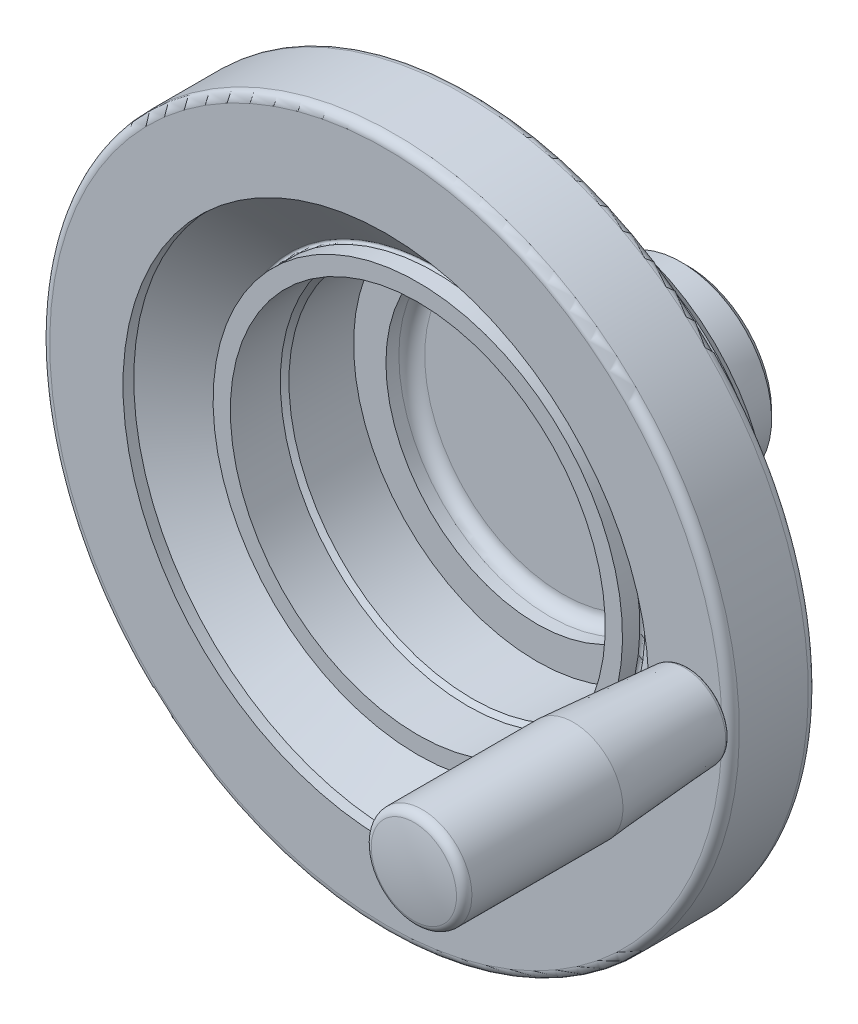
ISO-10303-21;
HEADER;
FILE_DESCRIPTION(('STEP AP214'),'2;1');
FILE_NAME('part.step','',(''),(''),'','','');
FILE_SCHEMA(('AUTOMOTIVE_DESIGN { 1 0 10303 214 1 1 1 1 }'));
ENDSEC;
DATA;
#1=APPLICATION_CONTEXT('core data for automotive mechanical design processes');
#2=APPLICATION_PROTOCOL_DEFINITION('international standard','automotive_design',2000,#1);
#3=PRODUCT_CONTEXT('',#1,'mechanical');
#4=PRODUCT('Part','Part','',(#3));
#5=PRODUCT_RELATED_PRODUCT_CATEGORY('part','',(#4));
#6=PRODUCT_DEFINITION_FORMATION('','',#4);
#7=PRODUCT_DEFINITION_CONTEXT('part definition',#1,'design');
#8=PRODUCT_DEFINITION('design','',#6,#7);
#9=PRODUCT_DEFINITION_SHAPE('','',#8);
#10=(LENGTH_UNIT() NAMED_UNIT(*) SI_UNIT(.MILLI.,.METRE.));
#11=(NAMED_UNIT(*) PLANE_ANGLE_UNIT() SI_UNIT($,.RADIAN.));
#12=(NAMED_UNIT(*) SI_UNIT($,.STERADIAN.) SOLID_ANGLE_UNIT());
#13=UNCERTAINTY_MEASURE_WITH_UNIT(LENGTH_MEASURE(1.E-05),#10,'distance_accuracy_value','');
#14=(GEOMETRIC_REPRESENTATION_CONTEXT(3) GLOBAL_UNCERTAINTY_ASSIGNED_CONTEXT((#13)) GLOBAL_UNIT_ASSIGNED_CONTEXT((#10,
#11,#12)) REPRESENTATION_CONTEXT('',''));
#15=CARTESIAN_POINT('',(0.,0.,0.));
#16=DIRECTION('',(0.,0.,1.));
#17=DIRECTION('',(1.,0.,0.));
#18=AXIS2_PLACEMENT_3D('',#15,#16,#17);
#19=CARTESIAN_POINT('',(0.,0.,62.6));
#20=DIRECTION('',(0.,0.,1.));
#21=DIRECTION('',(0.,-1.,0.));
#22=AXIS2_PLACEMENT_3D('',#19,#20,#21);
#23=PLANE('',#22);
#24=CARTESIAN_POINT('',(0.,0.,62.6));
#25=DIRECTION('',(0.,0.,1.));
#26=DIRECTION('',(0.,-1.,0.));
#27=AXIS2_PLACEMENT_3D('',#24,#25,#26);
#28=CIRCLE('',#27,47.5);
#29=CARTESIAN_POINT('',(0.,-47.5,62.6));
#30=VERTEX_POINT('',#29);
#31=EDGE_CURVE('E173',#30,#30,#28,.T.);
#32=ORIENTED_EDGE('',*,*,#31,.T.);
#33=EDGE_LOOP('',(#32));
#34=FACE_BOUND('',#33,.T.);
#35=CARTESIAN_POINT('',(0.,0.,62.6));
#36=DIRECTION('',(0.,0.,1.));
#37=DIRECTION('',(0.,-1.,0.));
#38=AXIS2_PLACEMENT_3D('',#35,#36,#37);
#39=CIRCLE('',#38,43.5);
#40=CARTESIAN_POINT('',(0.,-43.5,62.6));
#41=VERTEX_POINT('',#40);
#42=EDGE_CURVE('E18',#41,#41,#39,.F.);
#43=ORIENTED_EDGE('',*,*,#42,.T.);
#44=EDGE_LOOP('',(#43));
#45=FACE_BOUND('',#44,.T.);
#46=ADVANCED_FACE('F14',(#34,#45),#23,.T.);
#47=CARTESIAN_POINT('',(0.,0.,27.));
#48=DIRECTION('',(0.,0.,-1.));
#49=DIRECTION('',(0.,1.,0.));
#50=AXIS2_PLACEMENT_3D('',#47,#48,#49);
#51=CYLINDRICAL_SURFACE('',#50,4.);
#52=CARTESIAN_POINT('',(0.,0.,0.));
#53=DIRECTION('',(0.,0.,-1.));
#54=DIRECTION('',(0.,1.,0.));
#55=AXIS2_PLACEMENT_3D('',#52,#53,#54);
#56=CIRCLE('',#55,4.);
#57=CARTESIAN_POINT('',(0.,4.,0.));
#58=VERTEX_POINT('',#57);
#59=EDGE_CURVE('E197',#58,#58,#56,.T.);
#60=ORIENTED_EDGE('',*,*,#59,.T.);
#61=EDGE_LOOP('',(#60));
#62=FACE_BOUND('',#61,.T.);
#63=CARTESIAN_POINT('',(0.,0.,29.));
#64=DIRECTION('',(0.,0.,1.));
#65=DIRECTION('',(0.,-1.,0.));
#66=AXIS2_PLACEMENT_3D('',#63,#64,#65);
#67=CIRCLE('',#66,4.);
#68=CARTESIAN_POINT('',(0.,-4.,29.));
#69=VERTEX_POINT('',#68);
#70=EDGE_CURVE('E55',#69,#69,#67,.F.);
#71=ORIENTED_EDGE('',*,*,#70,.F.);
#72=EDGE_LOOP('',(#71));
#73=FACE_BOUND('',#72,.T.);
#74=ADVANCED_FACE('F95',(#62,#73),#51,.F.);
#75=CARTESIAN_POINT('',(-78.,0.,70.));
#76=DIRECTION('',(0.,0.,-1.));
#77=DIRECTION('',(0.,1.,0.));
#78=AXIS2_PLACEMENT_3D('',#75,#76,#77);
#79=PLANE('',#78);
#80=CARTESIAN_POINT('',(0.,0.,70.));
#81=DIRECTION('',(0.,0.,1.));
#82=DIRECTION('',(0.,-1.,0.));
#83=AXIS2_PLACEMENT_3D('',#80,#81,#82);
#84=CIRCLE('',#83,78.);
#85=CARTESIAN_POINT('',(0.,-78.,70.));
#86=VERTEX_POINT('',#85);
#87=EDGE_CURVE('E188',#86,#86,#84,.T.);
#88=ORIENTED_EDGE('',*,*,#87,.T.);
#89=EDGE_LOOP('',(#88));
#90=FACE_BOUND('',#89,.T.);
#91=CARTESIAN_POINT('',(0.,0.,70.));
#92=DIRECTION('',(0.,0.,1.));
#93=DIRECTION('',(0.,-1.,0.));
#94=AXIS2_PLACEMENT_3D('',#91,#92,#93);
#95=CIRCLE('',#94,61.);
#96=CARTESIAN_POINT('',(0.,-61.,70.));
#97=VERTEX_POINT('',#96);
#98=EDGE_CURVE('E185',#97,#97,#95,.T.);
#99=ORIENTED_EDGE('',*,*,#98,.F.);
#100=EDGE_LOOP('',(#99));
#101=FACE_BOUND('',#100,.T.);
#102=CARTESIAN_POINT('',(70.5,0.,70.));
#103=DIRECTION('',(0.,0.,-1.));
#104=DIRECTION('',(0.,1.,0.));
#105=AXIS2_PLACEMENT_3D('',#102,#103,#104);
#106=CIRCLE('',#105,6.);
#107=CARTESIAN_POINT('',(70.5,6.,70.));
#108=VERTEX_POINT('',#107);
#109=EDGE_CURVE('E22',#108,#108,#106,.F.);
#110=ORIENTED_EDGE('',*,*,#109,.F.);
#111=EDGE_LOOP('',(#110));
#112=FACE_BOUND('',#111,.T.);
#113=ADVANCED_FACE('F98',(#90,#101,#112),#79,.F.);
#114=CARTESIAN_POINT('',(0.,0.,52.));
#115=DIRECTION('',(0.,0.,1.));
#116=DIRECTION('',(0.,-1.,0.));
#117=AXIS2_PLACEMENT_3D('',#114,#115,#116);
#118=TOROIDAL_SURFACE('',#117,78.,2.);
#119=CARTESIAN_POINT('',(0.,0.,50.));
#120=DIRECTION('',(0.,0.,1.));
#121=DIRECTION('',(0.,-1.,0.));
#122=AXIS2_PLACEMENT_3D('',#119,#120,#121);
#123=CIRCLE('',#122,78.);
#124=CARTESIAN_POINT('',(0.,-78.,50.));
#125=VERTEX_POINT('',#124);
#126=EDGE_CURVE('E40',#125,#125,#123,.T.);
#127=ORIENTED_EDGE('',*,*,#126,.T.);
#128=EDGE_LOOP('',(#127));
#129=FACE_BOUND('',#128,.T.);
#130=CARTESIAN_POINT('',(0.,0.,52.));
#131=DIRECTION('',(0.,0.,1.));
#132=DIRECTION('',(0.,-1.,0.));
#133=AXIS2_PLACEMENT_3D('',#130,#131,#132);
#134=CIRCLE('',#133,80.);
#135=CARTESIAN_POINT('',(0.,-80.,52.));
#136=VERTEX_POINT('',#135);
#137=EDGE_CURVE('E194',#136,#136,#134,.T.);
#138=ORIENTED_EDGE('',*,*,#137,.F.);
#139=EDGE_LOOP('',(#138));
#140=FACE_BOUND('',#139,.T.);
#141=ADVANCED_FACE('F16',(#129,#140),#118,.T.);
#142=CARTESIAN_POINT('',(-78.,0.,50.));
#143=DIRECTION('',(0.,0.,-1.));
#144=DIRECTION('',(0.,1.,0.));
#145=AXIS2_PLACEMENT_3D('',#142,#143,#144);
#146=PLANE('',#145);
#147=CARTESIAN_POINT('',(0.,0.,50.));
#148=DIRECTION('',(0.,0.,1.));
#149=DIRECTION('',(0.,-1.,0.));
#150=AXIS2_PLACEMENT_3D('',#147,#148,#149);
#151=CIRCLE('',#150,50.1012903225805);
#152=CARTESIAN_POINT('',(0.,-50.1012903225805,50.));
#153=VERTEX_POINT('',#152);
#154=EDGE_CURVE('E36',#153,#153,#151,.T.);
#155=ORIENTED_EDGE('',*,*,#154,.T.);
#156=EDGE_LOOP('',(#155));
#157=FACE_BOUND('',#156,.T.);
#158=ORIENTED_EDGE('',*,*,#126,.F.);
#159=EDGE_LOOP('',(#158));
#160=FACE_BOUND('',#159,.T.);
#161=ADVANCED_FACE('F474',(#157,#160),#146,.T.);
#162=CARTESIAN_POINT('',(0.,0.,50.));
#163=DIRECTION('',(0.,0.,1.));
#164=DIRECTION('',(0.,-1.,0.));
#165=AXIS2_PLACEMENT_3D('',#162,#163,#164);
#166=CONICAL_SURFACE('',#165,50.1012903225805,0.857131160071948);
#167=CARTESIAN_POINT('',(0.,0.,48.7));
#168=DIRECTION('',(0.,0.,1.));
#169=DIRECTION('',(0.,-1.,0.));
#170=AXIS2_PLACEMENT_3D('',#167,#168,#169);
#171=CIRCLE('',#170,48.6);
#172=CARTESIAN_POINT('',(-48.6,0.,48.7));
#173=VERTEX_POINT('',#172);
#174=EDGE_CURVE('E32',#173,#173,#171,.T.);
#175=ORIENTED_EDGE('',*,*,#174,.T.);
#176=EDGE_LOOP('',(#175));
#177=FACE_BOUND('',#176,.T.);
#178=ORIENTED_EDGE('',*,*,#154,.F.);
#179=EDGE_LOOP('',(#178));
#180=FACE_BOUND('',#179,.T.);
#181=ADVANCED_FACE('F34',(#177,#180),#166,.T.);
#182=CARTESIAN_POINT('',(0.,0.,27.7));
#183=DIRECTION('',(0.,0.,1.));
#184=DIRECTION('',(0.,-1.,0.));
#185=AXIS2_PLACEMENT_3D('',#182,#183,#184);
#186=CONICAL_SURFACE('',#185,47.5,0.0523331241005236);
#187=ORIENTED_EDGE('',*,*,#174,.F.);
#188=CARTESIAN_POINT('',(-48.5042725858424,2.15559705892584,47.786482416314));
#189=CARTESIAN_POINT('',(-48.5158044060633,2.03864194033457,47.9073019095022));
#190=CARTESIAN_POINT('',(-48.5268567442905,1.91140178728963,48.0183726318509));
#191=CARTESIAN_POINT('',(-48.547240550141,1.63991321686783,48.2177582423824));
#192=CARTESIAN_POINT('',(-48.556570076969,1.4956459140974,48.3060475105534));
#193=CARTESIAN_POINT('',(-48.5728365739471,1.1942510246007,48.4572028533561));
#194=CARTESIAN_POINT('',(-48.5797740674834,1.03712626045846,48.5200744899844));
#195=CARTESIAN_POINT('',(-48.5907484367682,0.714499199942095,48.6185497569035));
#196=CARTESIAN_POINT('',(-48.5947860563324,0.548999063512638,48.6541603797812));
#197=CARTESIAN_POINT('',(-48.5996530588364,0.214995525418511,48.6970002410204));
#198=CARTESIAN_POINT('',(-48.6004952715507,0.0465068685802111,48.7043429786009));
#199=CARTESIAN_POINT('',(-48.5989440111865,-0.289313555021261,48.690742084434));
#200=CARTESIAN_POINT('',(-48.5965504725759,-0.456645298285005,48.669797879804));
#201=CARTESIAN_POINT('',(-48.5887157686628,-0.784966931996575,48.6003298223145));
#202=CARTESIAN_POINT('',(-48.5832822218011,-0.945971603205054,48.5518749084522));
#203=CARTESIAN_POINT('',(-48.5697699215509,-1.25755209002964,48.4288493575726));
#204=CARTESIAN_POINT('',(-48.5616911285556,-1.40812774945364,48.3542783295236));
#205=CARTESIAN_POINT('',(-48.5434328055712,-1.6951406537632,48.1808677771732));
#206=CARTESIAN_POINT('',(-48.5332462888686,-1.83152854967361,48.0819473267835));
#207=CARTESIAN_POINT('',(-48.5114932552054,-2.0858018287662,47.8627773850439));
#208=CARTESIAN_POINT('',(-48.4999266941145,-2.20368661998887,47.7425272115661));
#209=CARTESIAN_POINT('',(-48.4761082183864,-2.41829782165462,47.4833401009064));
#210=CARTESIAN_POINT('',(-48.4638528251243,-2.5149019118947,47.34430218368));
#211=CARTESIAN_POINT('',(-48.4394798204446,-2.68340074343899,47.0519704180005));
#212=CARTESIAN_POINT('',(-48.4273622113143,-2.75529507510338,46.8986763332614));
#213=CARTESIAN_POINT('',(-48.4039244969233,-2.87247207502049,46.5817652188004));
#214=CARTESIAN_POINT('',(-48.3926063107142,-2.91769250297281,46.4181250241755));
#215=CARTESIAN_POINT('',(-48.3713561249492,-2.97993900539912,46.0854793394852));
#216=CARTESIAN_POINT('',(-48.3614241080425,-2.99696543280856,45.9164739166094));
#217=CARTESIAN_POINT('',(-48.3433452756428,-3.00228627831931,45.5782838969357));
#218=CARTESIAN_POINT('',(-48.3351946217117,-2.99064315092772,45.4091004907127));
#219=CARTESIAN_POINT('',(-48.3208278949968,-2.93904252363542,45.0750240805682));
#220=CARTESIAN_POINT('',(-48.3146117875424,-2.89908553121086,44.9101309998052));
#221=CARTESIAN_POINT('',(-48.3041063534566,-2.79213730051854,44.5898734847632));
#222=CARTESIAN_POINT('',(-48.2998110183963,-2.72523162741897,44.4344806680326));
#223=CARTESIAN_POINT('',(-48.2929178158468,-2.56627382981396,44.1370975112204));
#224=CARTESIAN_POINT('',(-48.290319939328,-2.47422183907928,43.9951070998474));
#225=CARTESIAN_POINT('',(-48.2864890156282,-2.26768508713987,43.7287102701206));
#226=CARTESIAN_POINT('',(-48.2852546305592,-2.15322244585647,43.6042867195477));
#227=CARTESIAN_POINT('',(-48.283735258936,-1.9050517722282,43.3763908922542));
#228=CARTESIAN_POINT('',(-48.2834502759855,-1.77134366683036,43.2729186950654));
#229=CARTESIAN_POINT('',(-48.2834042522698,-1.488369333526,43.0897932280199));
#230=CARTESIAN_POINT('',(-48.2836435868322,-1.33909203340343,43.0101570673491));
#231=CARTESIAN_POINT('',(-48.2842673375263,-1.02929167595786,42.8770615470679));
#232=CARTESIAN_POINT('',(-48.2846517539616,-0.86876859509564,42.8236022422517));
#233=CARTESIAN_POINT('',(-48.2852858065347,-0.540941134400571,42.7443553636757));
#234=CARTESIAN_POINT('',(-48.2855353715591,-0.373633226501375,42.7185823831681));
#235=CARTESIAN_POINT('',(-48.2857570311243,-0.0370649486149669,42.6954902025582));
#236=CARTESIAN_POINT('',(-48.2857291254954,0.132195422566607,42.6981710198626));
#237=CARTESIAN_POINT('',(-48.28541087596,0.467861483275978,42.7319100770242));
#238=CARTESIAN_POINT('',(-48.2851205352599,0.634267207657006,42.7629679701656));
#239=CARTESIAN_POINT('',(-48.2844478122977,0.959502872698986,42.8525789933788));
#240=CARTESIAN_POINT('',(-48.2840654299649,1.11833280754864,42.9111321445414));
#241=CARTESIAN_POINT('',(-48.283511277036,1.42391465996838,43.0540745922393));
#242=CARTESIAN_POINT('',(-48.2833395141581,1.57066613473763,43.1384648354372));
#243=CARTESIAN_POINT('',(-48.2836001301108,1.84791826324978,43.3306852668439));
#244=CARTESIAN_POINT('',(-48.2840325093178,1.97841890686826,43.4385154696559));
#245=CARTESIAN_POINT('',(-48.2859303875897,2.21943631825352,43.6745262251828));
#246=CARTESIAN_POINT('',(-48.287395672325,2.32995722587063,43.80270255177));
#247=CARTESIAN_POINT('',(-48.2917612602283,2.52790783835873,44.075771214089));
#248=CARTESIAN_POINT('',(-48.2946615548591,2.61533768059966,44.2206634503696));
#249=CARTESIAN_POINT('',(-48.3022071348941,2.76456849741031,44.5229085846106));
#250=CARTESIAN_POINT('',(-48.3068510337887,2.82638975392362,44.6802515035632));
#251=CARTESIAN_POINT('',(-48.3180530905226,2.92276596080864,45.0030049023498));
#252=CARTESIAN_POINT('',(-48.3246111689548,2.95732204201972,45.1684150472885));
#253=CARTESIAN_POINT('',(-48.3396279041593,2.99822491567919,45.5025716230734));
#254=CARTESIAN_POINT('',(-48.3480862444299,3.00457640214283,45.6713174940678));
#255=CARTESIAN_POINT('',(-48.3666950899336,2.98894458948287,46.0074406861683));
#256=CARTESIAN_POINT('',(-48.376846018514,2.96695419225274,46.1748176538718));
#257=CARTESIAN_POINT('',(-48.3984608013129,2.89520466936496,46.5038901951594));
#258=CARTESIAN_POINT('',(-48.4099281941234,2.84536924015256,46.6655688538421));
#259=CARTESIAN_POINT('',(-48.4335670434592,2.71933683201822,46.9780992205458));
#260=CARTESIAN_POINT('',(-48.4457376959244,2.64316948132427,47.1289628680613));
#261=CARTESIAN_POINT('',(-48.4657684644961,2.49798497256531,47.3649095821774));
#262=CARTESIAN_POINT('',(-48.4736301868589,2.43597235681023,47.4543814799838));
#263=CARTESIAN_POINT('',(-48.4891523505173,2.30260683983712,47.6260895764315));
#264=CARTESIAN_POINT('',(-48.4968127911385,2.23125390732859,47.7083257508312));
#265=CARTESIAN_POINT('',(-48.5042725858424,2.15559705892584,47.786482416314));
#266=B_SPLINE_CURVE_WITH_KNOTS('',3,(#188,#189,#190,#191,#192,#193,#194,#195,#196,#197,#198,
#199,#200,#201,#202,#203,#204,#205,#206,#207,#208,#209,#210,#211,#212,#213,#214,#215,#216,#217,
#218,#219,#220,#221,#222,#223,#224,#225,#226,#227,#228,#229,#230,#231,#232,#233,#234,#235,#236,
#237,#238,#239,#240,#241,#242,#243,#244,#245,#246,#247,#248,#249,#250,#251,#252,#253,#254,#255,
#256,#257,#258,#259,#260,#261,#262,#263,#264,#265),.UNSPECIFIED.,.T.,.F.,(4,2,2,2,2,2,2,2,2,2,2,
2,2,2,2,2,2,2,2,2,2,2,2,2,2,2,2,2,2,2,2,2,2,2,2,2,2,2,4),(0.,0.50525296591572,1.01107168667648,
1.51677966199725,2.02235787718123,2.52590400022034,3.02946032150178,3.53176031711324,
4.03406783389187,4.53806787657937,5.04208404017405,5.54892575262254,6.0557758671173,
6.56380402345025,7.07182582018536,7.57874190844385,8.08564891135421,8.59095895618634,
9.09626631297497,9.60107740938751,10.10589042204,10.611064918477,11.1162404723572,
11.6216821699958,12.12712417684,12.6325600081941,13.137996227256,13.6434509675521,
14.1489060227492,14.654256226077,15.1596034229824,15.6645496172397,16.1694748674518,
16.6743160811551,17.1792837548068,17.6856420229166,18.1914323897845,18.5182733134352,
18.8451153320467),.UNSPECIFIED.);
#267=EDGE_CURVE('E9',#173,#173,#266,.T.);
#268=ORIENTED_EDGE('',*,*,#267,.T.);
#269=EDGE_LOOP('',(#187,#268));
#270=FACE_BOUND('',#269,.T.);
#271=CARTESIAN_POINT('',(0.,0.,27.7));
#272=DIRECTION('',(0.,0.,1.));
#273=DIRECTION('',(0.,-1.,0.));
#274=AXIS2_PLACEMENT_3D('',#271,#272,#273);
#275=CIRCLE('',#274,47.5);
#276=CARTESIAN_POINT('',(0.,-47.5,27.7));
#277=VERTEX_POINT('',#276);
#278=EDGE_CURVE('E37',#277,#277,#275,.T.);
#279=ORIENTED_EDGE('',*,*,#278,.T.);
#280=EDGE_LOOP('',(#279));
#281=FACE_BOUND('',#280,.T.);
#282=ADVANCED_FACE('F30',(#270,#281),#186,.T.);
#283=CARTESIAN_POINT('',(0.,0.,23.));
#284=DIRECTION('',(0.,0.,1.));
#285=DIRECTION('',(0.,-1.,0.));
#286=AXIS2_PLACEMENT_3D('',#283,#284,#285);
#287=CONICAL_SURFACE('',#286,42.,0.863669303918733);
#288=ORIENTED_EDGE('',*,*,#278,.F.);
#289=EDGE_LOOP('',(#288));
#290=FACE_BOUND('',#289,.T.);
#291=CARTESIAN_POINT('',(0.,0.,23.));
#292=DIRECTION('',(0.,0.,1.));
#293=DIRECTION('',(0.,-1.,0.));
#294=AXIS2_PLACEMENT_3D('',#291,#292,#293);
#295=CIRCLE('',#294,42.);
#296=CARTESIAN_POINT('',(0.,-42.,23.));
#297=VERTEX_POINT('',#296);
#298=EDGE_CURVE('E43',#297,#297,#295,.T.);
#299=ORIENTED_EDGE('',*,*,#298,.T.);
#300=EDGE_LOOP('',(#299));
#301=FACE_BOUND('',#300,.T.);
#302=ADVANCED_FACE('F147',(#290,#301),#287,.T.);
#303=CARTESIAN_POINT('',(-23.9954324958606,0.,23.));
#304=DIRECTION('',(0.,0.,1.));
#305=DIRECTION('',(0.,-1.,0.));
#306=AXIS2_PLACEMENT_3D('',#303,#304,#305);
#307=PLANE('',#306);
#308=ORIENTED_EDGE('',*,*,#298,.F.);
#309=EDGE_LOOP('',(#308));
#310=FACE_BOUND('',#309,.T.);
#311=CARTESIAN_POINT('',(0.,0.,23.));
#312=DIRECTION('',(0.,0.,1.));
#313=DIRECTION('',(0.,-1.,0.));
#314=AXIS2_PLACEMENT_3D('',#311,#312,#313);
#315=CIRCLE('',#314,23.9954324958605);
#316=CARTESIAN_POINT('',(0.,-23.9954324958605,23.));
#317=VERTEX_POINT('',#316);
#318=EDGE_CURVE('E160',#317,#317,#315,.T.);
#319=ORIENTED_EDGE('',*,*,#318,.T.);
#320=EDGE_LOOP('',(#319));
#321=FACE_BOUND('',#320,.T.);
#322=ADVANCED_FACE('F144',(#310,#321),#307,.F.);
#323=CARTESIAN_POINT('',(0.,0.,21.045753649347));
#324=DIRECTION('',(0.,0.,1.));
#325=DIRECTION('',(0.,-1.,0.));
#326=AXIS2_PLACEMENT_3D('',#323,#324,#325);
#327=TOROIDAL_SURFACE('',#326,23.5700841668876,2.);
#328=ORIENTED_EDGE('',*,*,#318,.F.);
#329=EDGE_LOOP('',(#328));
#330=FACE_BOUND('',#329,.T.);
#331=CARTESIAN_POINT('',(0.,0.,19.8088998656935));
#332=DIRECTION('',(0.,0.,1.));
#333=DIRECTION('',(0.,-1.,0.));
#334=AXIS2_PLACEMENT_3D('',#331,#332,#333);
#335=CIRCLE('',#334,21.9983994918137);
#336=CARTESIAN_POINT('',(0.,-21.9983994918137,19.8088998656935));
#337=VERTEX_POINT('',#336);
#338=EDGE_CURVE('E162',#337,#337,#335,.T.);
#339=ORIENTED_EDGE('',*,*,#338,.T.);
#340=EDGE_LOOP('',(#339));
#341=FACE_BOUND('',#340,.T.);
#342=ADVANCED_FACE('F140',(#330,#341),#327,.F.);
#343=CARTESIAN_POINT('',(0.,0.,1.5));
#344=DIRECTION('',(0.,0.,1.));
#345=DIRECTION('',(0.,-1.,0.));
#346=AXIS2_PLACEMENT_3D('',#343,#344,#345);
#347=CONICAL_SURFACE('',#346,21.,0.0544768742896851);
#348=ORIENTED_EDGE('',*,*,#338,.F.);
#349=EDGE_LOOP('',(#348));
#350=FACE_BOUND('',#349,.T.);
#351=CARTESIAN_POINT('',(0.,0.,1.5));
#352=DIRECTION('',(0.,0.,1.));
#353=DIRECTION('',(0.,-1.,0.));
#354=AXIS2_PLACEMENT_3D('',#351,#352,#353);
#355=CIRCLE('',#354,21.);
#356=CARTESIAN_POINT('',(0.,-21.,1.5));
#357=VERTEX_POINT('',#356);
#358=EDGE_CURVE('E167',#357,#357,#355,.T.);
#359=ORIENTED_EDGE('',*,*,#358,.T.);
#360=EDGE_LOOP('',(#359));
#361=FACE_BOUND('',#360,.T.);
#362=ADVANCED_FACE('F136',(#350,#361),#347,.T.);
#363=CARTESIAN_POINT('',(0.,0.,0.));
#364=DIRECTION('',(0.,0.,1.));
#365=DIRECTION('',(0.,-1.,0.));
#366=AXIS2_PLACEMENT_3D('',#363,#364,#365);
#367=CONICAL_SURFACE('',#366,19.5,0.785398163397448);
#368=ORIENTED_EDGE('',*,*,#358,.F.);
#369=EDGE_LOOP('',(#368));
#370=FACE_BOUND('',#369,.T.);
#371=CARTESIAN_POINT('',(0.,0.,0.));
#372=DIRECTION('',(0.,0.,1.));
#373=DIRECTION('',(0.,-1.,0.));
#374=AXIS2_PLACEMENT_3D('',#371,#372,#373);
#375=CIRCLE('',#374,19.5);
#376=CARTESIAN_POINT('',(0.,-19.5,0.));
#377=VERTEX_POINT('',#376);
#378=EDGE_CURVE('E170',#377,#377,#375,.T.);
#379=ORIENTED_EDGE('',*,*,#378,.T.);
#380=EDGE_LOOP('',(#379));
#381=FACE_BOUND('',#380,.T.);
#382=ADVANCED_FACE('F132',(#370,#381),#367,.T.);
#383=CARTESIAN_POINT('',(0.,0.,0.));
#384=DIRECTION('',(0.,0.,1.));
#385=DIRECTION('',(0.,-1.,0.));
#386=AXIS2_PLACEMENT_3D('',#383,#384,#385);
#387=PLANE('',#386);
#388=ORIENTED_EDGE('',*,*,#59,.F.);
#389=EDGE_LOOP('',(#388));
#390=FACE_BOUND('',#389,.T.);
#391=ORIENTED_EDGE('',*,*,#378,.F.);
#392=EDGE_LOOP('',(#391));
#393=FACE_BOUND('',#392,.T.);
#394=ADVANCED_FACE('F125',(#390,#393),#387,.F.);
#395=CARTESIAN_POINT('',(0.,0.,75.5516238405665));
#396=DIRECTION('',(0.,0.,1.));
#397=DIRECTION('',(0.,-1.,0.));
#398=AXIS2_PLACEMENT_3D('',#395,#396,#397);
#399=CYLINDRICAL_SURFACE('',#398,47.5);
#400=CARTESIAN_POINT('',(0.,0.,58.5867025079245));
#401=DIRECTION('',(0.,0.,1.));
#402=DIRECTION('',(0.,-1.,0.));
#403=AXIS2_PLACEMENT_3D('',#400,#401,#402);
#404=CIRCLE('',#403,47.5);
#405=CARTESIAN_POINT('',(0.,-47.5,58.5867025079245));
#406=VERTEX_POINT('',#405);
#407=EDGE_CURVE('E176',#406,#406,#404,.T.);
#408=ORIENTED_EDGE('',*,*,#407,.T.);
#409=EDGE_LOOP('',(#408));
#410=FACE_BOUND('',#409,.T.);
#411=ORIENTED_EDGE('',*,*,#31,.F.);
#412=EDGE_LOOP('',(#411));
#413=FACE_BOUND('',#412,.T.);
#414=ADVANCED_FACE('F121',(#410,#413),#399,.T.);
#415=CARTESIAN_POINT('',(0.,0.,58.5867025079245));
#416=DIRECTION('',(0.,0.,1.));
#417=DIRECTION('',(0.,-1.,0.));
#418=AXIS2_PLACEMENT_3D('',#415,#416,#417);
#419=TOROIDAL_SURFACE('',#418,48.,0.499999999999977);
#420=ORIENTED_EDGE('',*,*,#407,.F.);
#421=EDGE_LOOP('',(#420));
#422=FACE_BOUND('',#421,.T.);
#423=CARTESIAN_POINT('',(0.,0.,58.1835000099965));
#424=DIRECTION('',(0.,0.,1.));
#425=DIRECTION('',(0.,-1.,0.));
#426=AXIS2_PLACEMENT_3D('',#423,#424,#425);
#427=CIRCLE('',#426,48.2956818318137);
#428=CARTESIAN_POINT('',(0.,-48.2956818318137,58.1835000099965));
#429=VERTEX_POINT('',#428);
#430=EDGE_CURVE('E179',#429,#429,#427,.T.);
#431=ORIENTED_EDGE('',*,*,#430,.T.);
#432=EDGE_LOOP('',(#431));
#433=FACE_BOUND('',#432,.T.);
#434=ADVANCED_FACE('F117',(#422,#433),#419,.F.);
#435=CARTESIAN_POINT('',(0.,0.,67.5));
#436=DIRECTION('',(0.,0.,1.));
#437=DIRECTION('',(0.,-1.,0.));
#438=AXIS2_PLACEMENT_3D('',#435,#436,#437);
#439=CONICAL_SURFACE('',#438,61.,0.938047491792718);
#440=ORIENTED_EDGE('',*,*,#430,.F.);
#441=EDGE_LOOP('',(#440));
#442=FACE_BOUND('',#441,.T.);
#443=CARTESIAN_POINT('',(0.,0.,67.5));
#444=DIRECTION('',(0.,0.,1.));
#445=DIRECTION('',(0.,-1.,0.));
#446=AXIS2_PLACEMENT_3D('',#443,#444,#445);
#447=CIRCLE('',#446,61.);
#448=CARTESIAN_POINT('',(0.,-61.,67.5));
#449=VERTEX_POINT('',#448);
#450=EDGE_CURVE('E182',#449,#449,#447,.T.);
#451=ORIENTED_EDGE('',*,*,#450,.T.);
#452=EDGE_LOOP('',(#451));
#453=FACE_BOUND('',#452,.T.);
#454=ADVANCED_FACE('F113',(#442,#453),#439,.F.);
#455=CARTESIAN_POINT('',(0.,0.,75.5516238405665));
#456=DIRECTION('',(0.,0.,1.));
#457=DIRECTION('',(0.,-1.,0.));
#458=AXIS2_PLACEMENT_3D('',#455,#456,#457);
#459=CYLINDRICAL_SURFACE('',#458,61.);
#460=ORIENTED_EDGE('',*,*,#450,.F.);
#461=EDGE_LOOP('',(#460));
#462=FACE_BOUND('',#461,.T.);
#463=ORIENTED_EDGE('',*,*,#98,.T.);
#464=EDGE_LOOP('',(#463));
#465=FACE_BOUND('',#464,.T.);
#466=ADVANCED_FACE('F106',(#462,#465),#459,.F.);
#467=CARTESIAN_POINT('',(0.,0.,68.));
#468=DIRECTION('',(0.,0.,1.));
#469=DIRECTION('',(0.,-1.,0.));
#470=AXIS2_PLACEMENT_3D('',#467,#468,#469);
#471=TOROIDAL_SURFACE('',#470,78.,2.);
#472=CARTESIAN_POINT('',(0.,0.,68.));
#473=DIRECTION('',(0.,0.,1.));
#474=DIRECTION('',(0.,-1.,0.));
#475=AXIS2_PLACEMENT_3D('',#472,#473,#474);
#476=CIRCLE('',#475,80.);
#477=CARTESIAN_POINT('',(0.,-80.,68.));
#478=VERTEX_POINT('',#477);
#479=EDGE_CURVE('E191',#478,#478,#476,.T.);
#480=ORIENTED_EDGE('',*,*,#479,.T.);
#481=EDGE_LOOP('',(#480));
#482=FACE_BOUND('',#481,.T.);
#483=ORIENTED_EDGE('',*,*,#87,.F.);
#484=EDGE_LOOP('',(#483));
#485=FACE_BOUND('',#484,.T.);
#486=ADVANCED_FACE('F102',(#482,#485),#471,.T.);
#487=CARTESIAN_POINT('',(0.,0.,75.5516238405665));
#488=DIRECTION('',(0.,0.,1.));
#489=DIRECTION('',(0.,-1.,0.));
#490=AXIS2_PLACEMENT_3D('',#487,#488,#489);
#491=CYLINDRICAL_SURFACE('',#490,80.);
#492=ORIENTED_EDGE('',*,*,#479,.F.);
#493=EDGE_LOOP('',(#492));
#494=FACE_BOUND('',#493,.T.);
#495=ORIENTED_EDGE('',*,*,#137,.T.);
#496=EDGE_LOOP('',(#495));
#497=FACE_BOUND('',#496,.T.);
#498=ADVANCED_FACE('F93',(#494,#497),#491,.T.);
#499=CARTESIAN_POINT('',(70.5,0.,85.));
#500=DIRECTION('',(0.,-1.,0.));
#501=DIRECTION('',(0.,0.,-1.));
#502=AXIS2_PLACEMENT_3D('',#499,#500,#501);
#503=SPHERICAL_SURFACE('',#502,50.);
#504=CARTESIAN_POINT('',(70.5,0.,85.));
#505=DIRECTION('',(0.,0.,1.));
#506=DIRECTION('',(0.,-1.,0.));
#507=AXIS2_PLACEMENT_3D('',#504,#505,#506);
#508=SPHERICAL_SURFACE('',#507,50.);
#509=CARTESIAN_POINT('',(70.5,0.,134.010942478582));
#510=DIRECTION('',(0.,0.,1.));
#511=DIRECTION('',(0.,-1.,0.));
#512=AXIS2_PLACEMENT_3D('',#509,#510,#511);
#513=CIRCLE('',#512,9.8958333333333);
#514=CARTESIAN_POINT('',(70.5,-9.8958333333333,134.010942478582));
#515=VERTEX_POINT('',#514);
#516=EDGE_CURVE('E200',#515,#515,#513,.T.);
#517=ORIENTED_EDGE('',*,*,#516,.T.);
#518=EDGE_LOOP('',(#517));
#519=FACE_BOUND('',#518,.T.);
#520=ADVANCED_FACE('F89',(#519),#508,.T.);
#521=CARTESIAN_POINT('',(70.5,0.,132.050504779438));
#522=DIRECTION('',(0.,0.,1.));
#523=DIRECTION('',(0.,-1.,0.));
#524=AXIS2_PLACEMENT_3D('',#521,#522,#523);
#525=TOROIDAL_SURFACE('',#524,9.5,2.);
#526=CARTESIAN_POINT('',(70.5,0.,132.050504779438));
#527=DIRECTION('',(0.,0.,1.));
#528=DIRECTION('',(0.,-1.,0.));
#529=AXIS2_PLACEMENT_3D('',#526,#527,#528);
#530=CIRCLE('',#529,11.5);
#531=CARTESIAN_POINT('',(70.5,-11.5,132.050504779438));
#532=VERTEX_POINT('',#531);
#533=EDGE_CURVE('E203',#532,#532,#530,.T.);
#534=ORIENTED_EDGE('',*,*,#533,.T.);
#535=EDGE_LOOP('',(#534));
#536=FACE_BOUND('',#535,.T.);
#537=ORIENTED_EDGE('',*,*,#516,.F.);
#538=EDGE_LOOP('',(#537));
#539=FACE_BOUND('',#538,.T.);
#540=ADVANCED_FACE('F85',(#536,#539),#525,.T.);
#541=CARTESIAN_POINT('',(70.5,0.,139.536096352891));
#542=DIRECTION('',(0.,0.,1.));
#543=DIRECTION('',(0.,-1.,0.));
#544=AXIS2_PLACEMENT_3D('',#541,#542,#543);
#545=CYLINDRICAL_SURFACE('',#544,11.5);
#546=CARTESIAN_POINT('',(70.5,0.,97.));
#547=DIRECTION('',(0.,0.,1.));
#548=DIRECTION('',(0.,-1.,0.));
#549=AXIS2_PLACEMENT_3D('',#546,#547,#548);
#550=CIRCLE('',#549,11.5);
#551=CARTESIAN_POINT('',(70.5,-11.5,97.));
#552=VERTEX_POINT('',#551);
#553=EDGE_CURVE('E206',#552,#552,#550,.T.);
#554=ORIENTED_EDGE('',*,*,#553,.T.);
#555=EDGE_LOOP('',(#554));
#556=FACE_BOUND('',#555,.T.);
#557=ORIENTED_EDGE('',*,*,#533,.F.);
#558=EDGE_LOOP('',(#557));
#559=FACE_BOUND('',#558,.T.);
#560=ADVANCED_FACE('F81',(#556,#559),#545,.T.);
#561=CARTESIAN_POINT('',(70.5,0.,71.22530290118));
#562=DIRECTION('',(0.,0.,1.));
#563=DIRECTION('',(0.,-1.,0.));
#564=AXIS2_PLACEMENT_3D('',#561,#562,#563);
#565=CONICAL_SURFACE('',#564,9.56931107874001,0.0747667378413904);
#566=ORIENTED_EDGE('',*,*,#553,.F.);
#567=EDGE_LOOP('',(#566));
#568=FACE_BOUND('',#567,.T.);
#569=CARTESIAN_POINT('',(70.5,0.,71.22530290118));
#570=DIRECTION('',(0.,0.,1.));
#571=DIRECTION('',(0.,-1.,0.));
#572=AXIS2_PLACEMENT_3D('',#569,#570,#571);
#573=CIRCLE('',#572,9.56931107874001);
#574=CARTESIAN_POINT('',(70.5,-9.56931107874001,71.22530290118));
#575=VERTEX_POINT('',#574);
#576=EDGE_CURVE('E209',#575,#575,#573,.T.);
#577=ORIENTED_EDGE('',*,*,#576,.T.);
#578=EDGE_LOOP('',(#577));
#579=FACE_BOUND('',#578,.T.);
#580=ADVANCED_FACE('F77',(#568,#579),#565,.T.);
#581=CARTESIAN_POINT('',(70.5,0.,71.3));
#582=DIRECTION('',(0.,0.,1.));
#583=DIRECTION('',(0.,-1.,0.));
#584=AXIS2_PLACEMENT_3D('',#581,#582,#583);
#585=TOROIDAL_SURFACE('',#584,8.57210480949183,1.);
#586=CARTESIAN_POINT('',(70.5,0.,70.3));
#587=DIRECTION('',(0.,0.,1.));
#588=DIRECTION('',(0.,-1.,0.));
#589=AXIS2_PLACEMENT_3D('',#586,#587,#588);
#590=CIRCLE('',#589,8.57210480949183);
#591=CARTESIAN_POINT('',(70.5,-8.57210480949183,70.3));
#592=VERTEX_POINT('',#591);
#593=EDGE_CURVE('E212',#592,#592,#590,.T.);
#594=ORIENTED_EDGE('',*,*,#593,.T.);
#595=EDGE_LOOP('',(#594));
#596=FACE_BOUND('',#595,.T.);
#597=ORIENTED_EDGE('',*,*,#576,.F.);
#598=EDGE_LOOP('',(#597));
#599=FACE_BOUND('',#598,.T.);
#600=ADVANCED_FACE('F73',(#596,#599),#585,.T.);
#601=CARTESIAN_POINT('',(64.5,0.,70.3));
#602=DIRECTION('',(0.,0.,1.));
#603=DIRECTION('',(0.,-1.,0.));
#604=AXIS2_PLACEMENT_3D('',#601,#602,#603);
#605=PLANE('',#604);
#606=ORIENTED_EDGE('',*,*,#593,.F.);
#607=EDGE_LOOP('',(#606));
#608=FACE_BOUND('',#607,.T.);
#609=CARTESIAN_POINT('',(70.5,0.,70.3));
#610=DIRECTION('',(0.,0.,1.));
#611=DIRECTION('',(0.,-1.,0.));
#612=AXIS2_PLACEMENT_3D('',#609,#610,#611);
#613=CIRCLE('',#612,6.);
#614=CARTESIAN_POINT('',(70.5,-6.,70.3));
#615=VERTEX_POINT('',#614);
#616=EDGE_CURVE('E215',#615,#615,#613,.T.);
#617=ORIENTED_EDGE('',*,*,#616,.T.);
#618=EDGE_LOOP('',(#617));
#619=FACE_BOUND('',#618,.T.);
#620=ADVANCED_FACE('F69',(#608,#619),#605,.F.);
#621=CARTESIAN_POINT('',(70.5,0.,139.536096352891));
#622=DIRECTION('',(0.,0.,1.));
#623=DIRECTION('',(0.,-1.,0.));
#624=AXIS2_PLACEMENT_3D('',#621,#622,#623);
#625=CYLINDRICAL_SURFACE('',#624,6.);
#626=ORIENTED_EDGE('',*,*,#616,.F.);
#627=EDGE_LOOP('',(#626));
#628=FACE_BOUND('',#627,.T.);
#629=ORIENTED_EDGE('',*,*,#109,.T.);
#630=EDGE_LOOP('',(#629));
#631=FACE_BOUND('',#630,.T.);
#632=ADVANCED_FACE('F64',(#628,#631),#625,.T.);
#633=CARTESIAN_POINT('',(-44.54164332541,0.,45.7));
#634=DIRECTION('',(1.,0.,0.));
#635=DIRECTION('',(0.,-1.,0.));
#636=AXIS2_PLACEMENT_3D('',#633,#634,#635);
#637=CYLINDRICAL_SURFACE('',#636,2.99999999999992);
#638=CARTESIAN_POINT('',(-45.442857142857,0.,45.7));
#639=DIRECTION('',(1.,0.,0.));
#640=DIRECTION('',(0.,-1.,0.));
#641=AXIS2_PLACEMENT_3D('',#638,#639,#640);
#642=CIRCLE('',#641,2.99999999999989);
#643=CARTESIAN_POINT('',(-45.442857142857,-2.99999999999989,45.7));
#644=VERTEX_POINT('',#643);
#645=EDGE_CURVE('E218',#644,#644,#642,.T.);
#646=ORIENTED_EDGE('',*,*,#645,.T.);
#647=EDGE_LOOP('',(#646));
#648=FACE_BOUND('',#647,.T.);
#649=ORIENTED_EDGE('',*,*,#267,.F.);
#650=EDGE_LOOP('',(#649));
#651=FACE_BOUND('',#650,.T.);
#652=ADVANCED_FACE('F26',(#648,#651),#637,.F.);
#653=CARTESIAN_POINT('',(-45.442857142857,0.,48.7));
#654=DIRECTION('',(-1.,0.,0.));
#655=DIRECTION('',(0.,1.,0.));
#656=AXIS2_PLACEMENT_3D('',#653,#654,#655);
#657=PLANE('',#656);
#658=ORIENTED_EDGE('',*,*,#645,.F.);
#659=EDGE_LOOP('',(#658));
#660=FACE_BOUND('',#659,.T.);
#661=ADVANCED_FACE('F63',(#660),#657,.T.);
#662=CARTESIAN_POINT('',(0.,32.,29.));
#663=DIRECTION('',(0.,0.,1.));
#664=DIRECTION('',(0.,-1.,0.));
#665=AXIS2_PLACEMENT_3D('',#662,#663,#664);
#666=PLANE('',#665);
#667=CARTESIAN_POINT('',(0.,0.,29.));
#668=DIRECTION('',(0.,0.,1.));
#669=DIRECTION('',(0.,-1.,0.));
#670=AXIS2_PLACEMENT_3D('',#667,#668,#669);
#671=CIRCLE('',#670,32.);
#672=CARTESIAN_POINT('',(0.,-32.,29.));
#673=VERTEX_POINT('',#672);
#674=EDGE_CURVE('E236',#673,#673,#671,.T.);
#675=ORIENTED_EDGE('',*,*,#674,.T.);
#676=EDGE_LOOP('',(#675));
#677=FACE_BOUND('',#676,.T.);
#678=ORIENTED_EDGE('',*,*,#70,.T.);
#679=EDGE_LOOP('',(#678));
#680=FACE_BOUND('',#679,.T.);
#681=ADVANCED_FACE('F240',(#677,#680),#666,.T.);
#682=CARTESIAN_POINT('',(0.,0.,116.433821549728));
#683=DIRECTION('',(0.,0.,1.));
#684=DIRECTION('',(0.,-1.,0.));
#685=AXIS2_PLACEMENT_3D('',#682,#683,#684);
#686=CYLINDRICAL_SURFACE('',#685,43.5);
#687=ORIENTED_EDGE('',*,*,#42,.F.);
#688=EDGE_LOOP('',(#687));
#689=FACE_BOUND('',#688,.T.);
#690=CARTESIAN_POINT('',(0.,0.,51.));
#691=DIRECTION('',(0.,0.,1.));
#692=DIRECTION('',(0.,-1.,0.));
#693=AXIS2_PLACEMENT_3D('',#690,#691,#692);
#694=CIRCLE('',#693,43.5);
#695=CARTESIAN_POINT('',(0.,-43.5,51.));
#696=VERTEX_POINT('',#695);
#697=EDGE_CURVE('E221',#696,#696,#694,.T.);
#698=ORIENTED_EDGE('',*,*,#697,.F.);
#699=EDGE_LOOP('',(#698));
#700=FACE_BOUND('',#699,.T.);
#701=ADVANCED_FACE('F266',(#689,#700),#686,.F.);
#702=CARTESIAN_POINT('',(0.,0.,50.));
#703=DIRECTION('',(0.,0.,1.));
#704=DIRECTION('',(0.,-1.,0.));
#705=AXIS2_PLACEMENT_3D('',#702,#703,#704);
#706=CONICAL_SURFACE('',#705,42.5,0.785398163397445);
#707=ORIENTED_EDGE('',*,*,#697,.T.);
#708=EDGE_LOOP('',(#707));
#709=FACE_BOUND('',#708,.T.);
#710=CARTESIAN_POINT('',(0.,0.,50.));
#711=DIRECTION('',(0.,0.,1.));
#712=DIRECTION('',(0.,-1.,0.));
#713=AXIS2_PLACEMENT_3D('',#710,#711,#712);
#714=CIRCLE('',#713,42.5);
#715=CARTESIAN_POINT('',(0.,-42.5,50.));
#716=VERTEX_POINT('',#715);
#717=EDGE_CURVE('E224',#716,#716,#714,.T.);
#718=ORIENTED_EDGE('',*,*,#717,.F.);
#719=EDGE_LOOP('',(#718));
#720=FACE_BOUND('',#719,.T.);
#721=ADVANCED_FACE('F263',(#709,#720),#706,.F.);
#722=CARTESIAN_POINT('',(0.,0.,116.433821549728));
#723=DIRECTION('',(0.,0.,1.));
#724=DIRECTION('',(0.,-1.,0.));
#725=AXIS2_PLACEMENT_3D('',#722,#723,#724);
#726=CYLINDRICAL_SURFACE('',#725,42.5);
#727=ORIENTED_EDGE('',*,*,#717,.T.);
#728=EDGE_LOOP('',(#727));
#729=FACE_BOUND('',#728,.T.);
#730=CARTESIAN_POINT('',(0.,0.,35.));
#731=DIRECTION('',(0.,0.,1.));
#732=DIRECTION('',(0.,-1.,0.));
#733=AXIS2_PLACEMENT_3D('',#730,#731,#732);
#734=CIRCLE('',#733,42.5);
#735=CARTESIAN_POINT('',(0.,-42.5,35.));
#736=VERTEX_POINT('',#735);
#737=EDGE_CURVE('E227',#736,#736,#734,.T.);
#738=ORIENTED_EDGE('',*,*,#737,.F.);
#739=EDGE_LOOP('',(#738));
#740=FACE_BOUND('',#739,.T.);
#741=ADVANCED_FACE('F259',(#729,#740),#726,.F.);
#742=CARTESIAN_POINT('',(0.,42.5,35.));
#743=DIRECTION('',(0.,0.,1.));
#744=DIRECTION('',(0.,-1.,0.));
#745=AXIS2_PLACEMENT_3D('',#742,#743,#744);
#746=PLANE('',#745);
#747=ORIENTED_EDGE('',*,*,#737,.T.);
#748=EDGE_LOOP('',(#747));
#749=FACE_BOUND('',#748,.T.);
#750=CARTESIAN_POINT('',(0.,0.,35.));
#751=DIRECTION('',(0.,0.,1.));
#752=DIRECTION('',(0.,-1.,0.));
#753=AXIS2_PLACEMENT_3D('',#750,#751,#752);
#754=CIRCLE('',#753,35.);
#755=CARTESIAN_POINT('',(0.,-35.,35.));
#756=VERTEX_POINT('',#755);
#757=EDGE_CURVE('E230',#756,#756,#754,.T.);
#758=ORIENTED_EDGE('',*,*,#757,.F.);
#759=EDGE_LOOP('',(#758));
#760=FACE_BOUND('',#759,.T.);
#761=ADVANCED_FACE('F252',(#749,#760),#746,.T.);
#762=CARTESIAN_POINT('',(0.,0.,116.433821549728));
#763=DIRECTION('',(0.,0.,1.));
#764=DIRECTION('',(0.,-1.,0.));
#765=AXIS2_PLACEMENT_3D('',#762,#763,#764);
#766=CYLINDRICAL_SURFACE('',#765,35.);
#767=ORIENTED_EDGE('',*,*,#757,.T.);
#768=EDGE_LOOP('',(#767));
#769=FACE_BOUND('',#768,.T.);
#770=CARTESIAN_POINT('',(0.,0.,32.));
#771=DIRECTION('',(0.,0.,1.));
#772=DIRECTION('',(0.,-1.,0.));
#773=AXIS2_PLACEMENT_3D('',#770,#771,#772);
#774=CIRCLE('',#773,35.);
#775=CARTESIAN_POINT('',(0.,-35.,32.));
#776=VERTEX_POINT('',#775);
#777=EDGE_CURVE('E233',#776,#776,#774,.T.);
#778=ORIENTED_EDGE('',*,*,#777,.F.);
#779=EDGE_LOOP('',(#778));
#780=FACE_BOUND('',#779,.T.);
#781=ADVANCED_FACE('F245',(#769,#780),#766,.F.);
#782=CARTESIAN_POINT('',(0.,0.,32.));
#783=DIRECTION('',(0.,0.,1.));
#784=DIRECTION('',(0.,-1.,0.));
#785=AXIS2_PLACEMENT_3D('',#782,#783,#784);
#786=TOROIDAL_SURFACE('',#785,32.,3.);
#787=ORIENTED_EDGE('',*,*,#777,.T.);
#788=EDGE_LOOP('',(#787));
#789=FACE_BOUND('',#788,.T.);
#790=ORIENTED_EDGE('',*,*,#674,.F.);
#791=EDGE_LOOP('',(#790));
#792=FACE_BOUND('',#791,.T.);
#793=ADVANCED_FACE('F243',(#789,#792),#786,.F.);
#794=CLOSED_SHELL('',(#46,#74,#113,#141,#161,#181,#282,#302,#322,#342,#362,#382,#394,#414,#434,
#454,#466,#486,#498,#520,#540,#560,#580,#600,#620,#632,#652,#661,#681,#701,#721,#741,#761,#781,#793));
#795=MANIFOLD_SOLID_BREP('B1',#794);
#796=ADVANCED_BREP_SHAPE_REPRESENTATION('',(#18,#795),#14);
#797=SHAPE_DEFINITION_REPRESENTATION(#9,#796);
ENDSEC;
END-ISO-10303-21;
